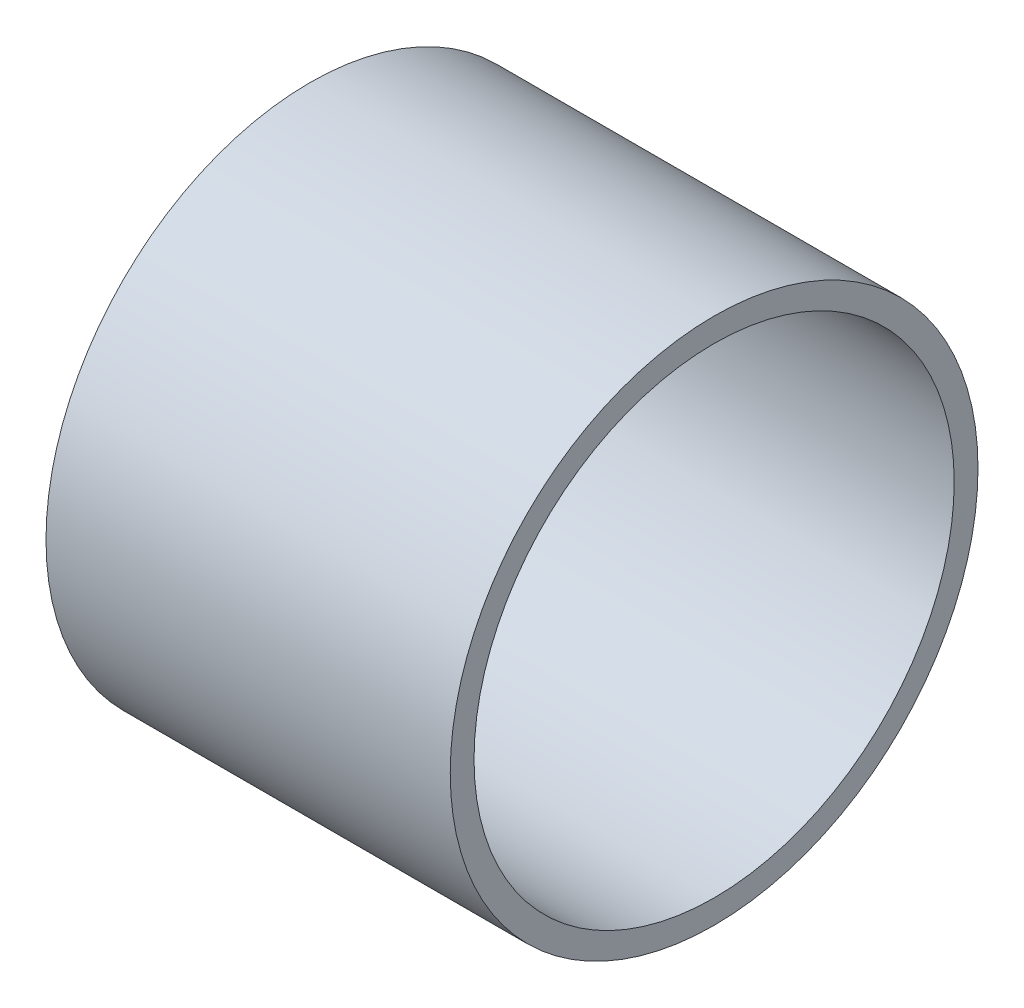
ISO-10303-21;
HEADER;
FILE_DESCRIPTION(('STEP AP214'),'2;1');
FILE_NAME('part.step','',(''),(''),'','','');
FILE_SCHEMA(('AUTOMOTIVE_DESIGN { 1 0 10303 214 1 1 1 1 }'));
ENDSEC;
DATA;
#1=APPLICATION_CONTEXT('core data for automotive mechanical design processes');
#2=APPLICATION_PROTOCOL_DEFINITION('international standard','automotive_design',2000,#1);
#3=PRODUCT_CONTEXT('',#1,'mechanical');
#4=PRODUCT('Part','Part','',(#3));
#5=PRODUCT_RELATED_PRODUCT_CATEGORY('part','',(#4));
#6=PRODUCT_DEFINITION_FORMATION('','',#4);
#7=PRODUCT_DEFINITION_CONTEXT('part definition',#1,'design');
#8=PRODUCT_DEFINITION('design','',#6,#7);
#9=PRODUCT_DEFINITION_SHAPE('','',#8);
#10=(LENGTH_UNIT() NAMED_UNIT(*) SI_UNIT(.MILLI.,.METRE.));
#11=(NAMED_UNIT(*) PLANE_ANGLE_UNIT() SI_UNIT($,.RADIAN.));
#12=(NAMED_UNIT(*) SI_UNIT($,.STERADIAN.) SOLID_ANGLE_UNIT());
#13=UNCERTAINTY_MEASURE_WITH_UNIT(LENGTH_MEASURE(1.E-05),#10,'distance_accuracy_value','');
#14=(GEOMETRIC_REPRESENTATION_CONTEXT(3) GLOBAL_UNCERTAINTY_ASSIGNED_CONTEXT((#13)) GLOBAL_UNIT_ASSIGNED_CONTEXT((#10,
#11,#12)) REPRESENTATION_CONTEXT('',''));
#15=CARTESIAN_POINT('',(0.,0.,0.));
#16=DIRECTION('',(0.,0.,1.));
#17=DIRECTION('',(1.,0.,0.));
#18=AXIS2_PLACEMENT_3D('',#15,#16,#17);
#19=CARTESIAN_POINT('',(693.,-7.90690236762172,0.));
#20=DIRECTION('',(1.,0.,0.));
#21=DIRECTION('',(0.,0.,-1.));
#22=AXIS2_PLACEMENT_3D('',#19,#20,#21);
#23=CYLINDRICAL_SURFACE('',#22,69.85);
#24=CARTESIAN_POINT('',(693.,-7.90690236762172,0.));
#25=DIRECTION('',(1.,0.,0.));
#26=DIRECTION('',(0.,0.,-1.));
#27=AXIS2_PLACEMENT_3D('',#24,#25,#26);
#28=CIRCLE('',#27,69.85);
#29=CARTESIAN_POINT('',(693.,-7.90690236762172,-69.85));
#30=VERTEX_POINT('',#29);
#31=EDGE_CURVE('E11',#30,#30,#28,.T.);
#32=ORIENTED_EDGE('',*,*,#31,.T.);
#33=EDGE_LOOP('',(#32));
#34=FACE_BOUND('',#33,.T.);
#35=CARTESIAN_POINT('',(800.,-7.90690236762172,0.));
#36=DIRECTION('',(1.,0.,0.));
#37=DIRECTION('',(0.,0.,-1.));
#38=AXIS2_PLACEMENT_3D('',#35,#36,#37);
#39=CIRCLE('',#38,69.85);
#40=CARTESIAN_POINT('',(800.,-7.90690236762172,-69.85));
#41=VERTEX_POINT('',#40);
#42=EDGE_CURVE('E38',#41,#41,#39,.T.);
#43=ORIENTED_EDGE('',*,*,#42,.F.);
#44=EDGE_LOOP('',(#43));
#45=FACE_BOUND('',#44,.T.);
#46=ADVANCED_FACE('F35',(#34,#45),#23,.T.);
#47=CARTESIAN_POINT('',(693.,-7.90690236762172,0.));
#48=DIRECTION('',(1.,0.,0.));
#49=DIRECTION('',(0.,0.,-1.));
#50=AXIS2_PLACEMENT_3D('',#47,#48,#49);
#51=PLANE('',#50);
#52=CARTESIAN_POINT('',(693.,-7.90690236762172,0.));
#53=DIRECTION('',(1.,0.,0.));
#54=DIRECTION('',(0.,0.,-1.));
#55=AXIS2_PLACEMENT_3D('',#52,#53,#54);
#56=CIRCLE('',#55,63.55);
#57=CARTESIAN_POINT('',(693.,-7.90690236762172,-63.55));
#58=VERTEX_POINT('',#57);
#59=EDGE_CURVE('E45',#58,#58,#56,.T.);
#60=ORIENTED_EDGE('',*,*,#59,.T.);
#61=EDGE_LOOP('',(#60));
#62=FACE_BOUND('',#61,.T.);
#63=ORIENTED_EDGE('',*,*,#31,.F.);
#64=EDGE_LOOP('',(#63));
#65=FACE_BOUND('',#64,.T.);
#66=ADVANCED_FACE('F53',(#62,#65),#51,.F.);
#67=CARTESIAN_POINT('',(800.,-7.90690236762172,0.));
#68=DIRECTION('',(1.,0.,0.));
#69=DIRECTION('',(0.,0.,-1.));
#70=AXIS2_PLACEMENT_3D('',#67,#68,#69);
#71=PLANE('',#70);
#72=CARTESIAN_POINT('',(800.,-7.90690236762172,0.));
#73=DIRECTION('',(1.,0.,0.));
#74=DIRECTION('',(0.,0.,-1.));
#75=AXIS2_PLACEMENT_3D('',#72,#73,#74);
#76=CIRCLE('',#75,63.55);
#77=CARTESIAN_POINT('',(800.,-7.90690236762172,-63.55));
#78=VERTEX_POINT('',#77);
#79=EDGE_CURVE('E47',#78,#78,#76,.T.);
#80=ORIENTED_EDGE('',*,*,#79,.F.);
#81=EDGE_LOOP('',(#80));
#82=FACE_BOUND('',#81,.T.);
#83=ORIENTED_EDGE('',*,*,#42,.T.);
#84=EDGE_LOOP('',(#83));
#85=FACE_BOUND('',#84,.T.);
#86=ADVANCED_FACE('F59',(#82,#85),#71,.T.);
#87=CARTESIAN_POINT('',(693.,-7.90690236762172,0.));
#88=DIRECTION('',(1.,0.,0.));
#89=DIRECTION('',(0.,0.,-1.));
#90=AXIS2_PLACEMENT_3D('',#87,#88,#89);
#91=CYLINDRICAL_SURFACE('',#90,63.55);
#92=ORIENTED_EDGE('',*,*,#59,.F.);
#93=EDGE_LOOP('',(#92));
#94=FACE_BOUND('',#93,.T.);
#95=ORIENTED_EDGE('',*,*,#79,.T.);
#96=EDGE_LOOP('',(#95));
#97=FACE_BOUND('',#96,.T.);
#98=ADVANCED_FACE('F56',(#94,#97),#91,.F.);
#99=CLOSED_SHELL('',(#46,#66,#86,#98));
#100=MANIFOLD_SOLID_BREP('B2',#99);
#101=ADVANCED_BREP_SHAPE_REPRESENTATION('',(#18,#100),#14);
#102=SHAPE_DEFINITION_REPRESENTATION(#9,#101);
ENDSEC;
END-ISO-10303-21;
